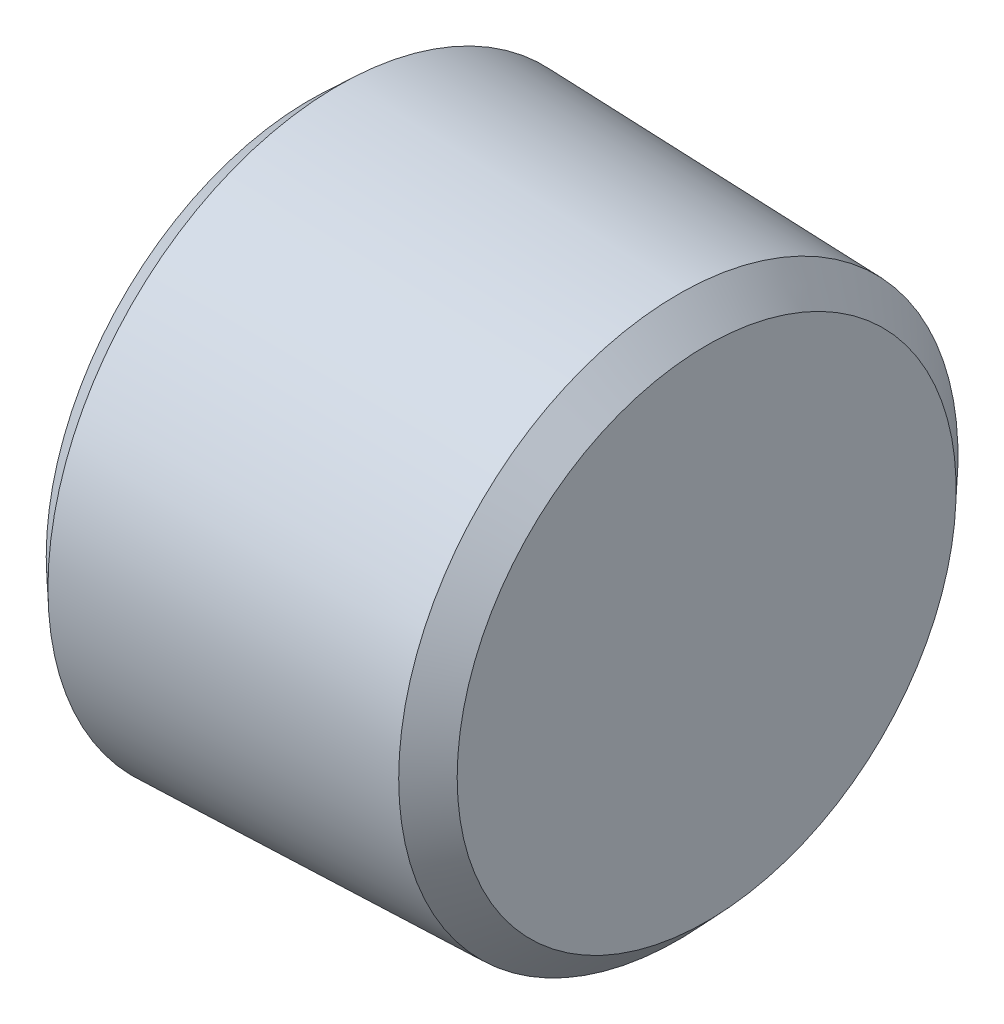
from build123d import *

# Parameters (mm, degrees)
CUT_EXTRUDE_1_DEPTH = 3.5


with BuildPart() as part:
    # Sketch 1 → Revolve 1 (revolve)
    with BuildSketch(Plane.XY, mode=Mode.PRIVATE) as revolve_1_sk:
        Polygon((0, 0), (0, 4.651531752), (0.499756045, 5.121), (6.500243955, 4.933487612), (7, 4.401489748), (7, 0), align=None)
    revolve(revolve_1_sk.sketch.rotate(Axis((0, 0, 0), (1, 0, 0)), 90), axis=Axis((0, 0, 0), (1, 0, 0)))

    # Sketch 2 → Cut-Extrude 1 (cut)
    with BuildSketch(Plane(origin=(0, 0, 0), x_dir=(0, 0, -1), z_dir=(1, 0, 0))):
        Polygon((0, 2.886751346), (-2.5, 1.443375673), (-2.5, -1.443375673), (0, -2.886751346), (2.5, -1.443375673), (2.5, 1.443375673), align=None)
    extrude(amount=CUT_EXTRUDE_1_DEPTH, mode=Mode.SUBTRACT)

    # Sketch 3 → Cut-Revolve 4 (revolve, cut)
    with BuildSketch(Plane(origin=(0, 0, 0), x_dir=(1, 0, 0), z_dir=(0, 1, 0))):
        Polygon((3.5, 0), (3.5, -2.5), (4.943375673, 0), align=None)
    revolve(axis=Axis((0, 0, 0), (1, 0, 0)), mode=Mode.SUBTRACT)


solid = part.part
